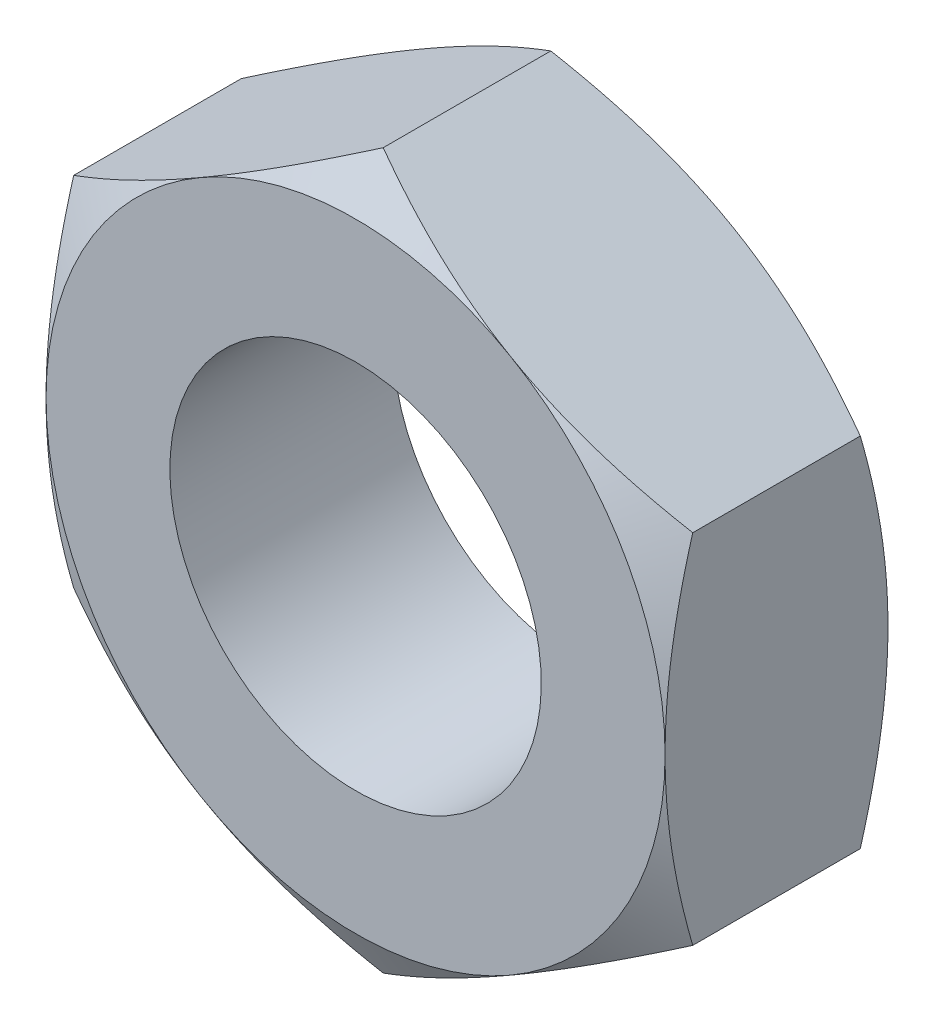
ISO-10303-21;
HEADER;
FILE_DESCRIPTION(('STEP AP214'),'2;1');
FILE_NAME('part.step','',(''),(''),'','','');
FILE_SCHEMA(('AUTOMOTIVE_DESIGN { 1 0 10303 214 1 1 1 1 }'));
ENDSEC;
DATA;
#1=APPLICATION_CONTEXT('core data for automotive mechanical design processes');
#2=APPLICATION_PROTOCOL_DEFINITION('international standard','automotive_design',2000,#1);
#3=PRODUCT_CONTEXT('',#1,'mechanical');
#4=PRODUCT('Part','Part','',(#3));
#5=PRODUCT_RELATED_PRODUCT_CATEGORY('part','',(#4));
#6=PRODUCT_DEFINITION_FORMATION('','',#4);
#7=PRODUCT_DEFINITION_CONTEXT('part definition',#1,'design');
#8=PRODUCT_DEFINITION('design','',#6,#7);
#9=PRODUCT_DEFINITION_SHAPE('','',#8);
#10=(LENGTH_UNIT() NAMED_UNIT(*) SI_UNIT(.MILLI.,.METRE.));
#11=(NAMED_UNIT(*) PLANE_ANGLE_UNIT() SI_UNIT($,.RADIAN.));
#12=(NAMED_UNIT(*) SI_UNIT($,.STERADIAN.) SOLID_ANGLE_UNIT());
#13=UNCERTAINTY_MEASURE_WITH_UNIT(LENGTH_MEASURE(1.E-05),#10,'distance_accuracy_value','');
#14=(GEOMETRIC_REPRESENTATION_CONTEXT(3) GLOBAL_UNCERTAINTY_ASSIGNED_CONTEXT((#13)) GLOBAL_UNIT_ASSIGNED_CONTEXT((#10,
#11,#12)) REPRESENTATION_CONTEXT('',''));
#15=CARTESIAN_POINT('',(0.,0.,0.));
#16=DIRECTION('',(0.,0.,1.));
#17=DIRECTION('',(1.,0.,0.));
#18=AXIS2_PLACEMENT_3D('',#15,#16,#17);
#19=CARTESIAN_POINT('',(0.,0.,3.6));
#20=DIRECTION('',(0.,0.,-1.));
#21=DIRECTION('',(0.,1.,0.));
#22=AXIS2_PLACEMENT_3D('',#19,#20,#21);
#23=PLANE('',#22);
#24=CARTESIAN_POINT('',(0.,0.,3.6));
#25=DIRECTION('',(0.,0.,-1.));
#26=DIRECTION('',(0.,1.,0.));
#27=AXIS2_PLACEMENT_3D('',#24,#25,#26);
#28=CIRCLE('',#27,3.);
#29=CARTESIAN_POINT('',(0.,3.,3.6));
#30=VERTEX_POINT('',#29);
#31=EDGE_CURVE('E263',#30,#30,#28,.T.);
#32=ORIENTED_EDGE('',*,*,#31,.T.);
#33=EDGE_LOOP('',(#32));
#34=FACE_BOUND('',#33,.T.);
#35=CARTESIAN_POINT('',(0.,0.,3.6));
#36=DIRECTION('',(0.,0.,-1.));
#37=DIRECTION('',(0.,1.,0.));
#38=AXIS2_PLACEMENT_3D('',#35,#36,#37);
#39=CIRCLE('',#38,5.);
#40=CARTESIAN_POINT('',(2.5,4.3301270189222,3.6));
#41=VERTEX_POINT('',#40);
#42=CARTESIAN_POINT('',(-2.5,4.33012701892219,3.6));
#43=VERTEX_POINT('',#42);
#44=EDGE_CURVE('E20',#41,#43,#39,.F.);
#45=ORIENTED_EDGE('',*,*,#44,.T.);
#46=CARTESIAN_POINT('',(-5.,0.,3.6));
#47=VERTEX_POINT('',#46);
#48=EDGE_CURVE('E10',#43,#47,#39,.F.);
#49=ORIENTED_EDGE('',*,*,#48,.T.);
#50=CARTESIAN_POINT('',(-2.5,-4.3301270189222,3.6));
#51=VERTEX_POINT('',#50);
#52=EDGE_CURVE('E25',#47,#51,#39,.F.);
#53=ORIENTED_EDGE('',*,*,#52,.T.);
#54=CARTESIAN_POINT('',(2.5,-4.33012701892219,3.6));
#55=VERTEX_POINT('',#54);
#56=EDGE_CURVE('E351',#51,#55,#39,.F.);
#57=ORIENTED_EDGE('',*,*,#56,.T.);
#58=CARTESIAN_POINT('',(5.,0.,3.6));
#59=VERTEX_POINT('',#58);
#60=EDGE_CURVE('E123',#55,#59,#39,.F.);
#61=ORIENTED_EDGE('',*,*,#60,.T.);
#62=CARTESIAN_POINT('',(0.,0.,3.6));
#63=DIRECTION('',(0.,0.,-1.));
#64=DIRECTION('',(0.,1.,0.));
#65=AXIS2_PLACEMENT_3D('',#62,#63,#64);
#66=CIRCLE('',#65,5.);
#67=EDGE_CURVE('E108',#41,#59,#66,.T.);
#68=ORIENTED_EDGE('',*,*,#67,.F.);
#69=EDGE_LOOP('',(#45,#49,#53,#57,#61,#68));
#70=FACE_BOUND('',#69,.T.);
#71=ADVANCED_FACE('F15',(#34,#70),#23,.F.);
#72=CARTESIAN_POINT('',(5.,-2.88675134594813,3.6));
#73=DIRECTION('',(0.5,-0.866025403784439,0.));
#74=DIRECTION('',(-0.866025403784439,-0.5,0.));
#75=AXIS2_PLACEMENT_3D('',#72,#73,#74);
#76=PLANE('',#75);
#77=CARTESIAN_POINT('',(-0.000200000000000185,-5.7736181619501,3.15335134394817));
#78=CARTESIAN_POINT('',(0.219534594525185,-5.64675433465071,3.22661343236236));
#79=CARTESIAN_POINT('',(0.441148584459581,-5.5188054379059,3.29324867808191));
#80=CARTESIAN_POINT('',(0.888213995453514,-5.26069210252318,3.40956100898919));
#81=CARTESIAN_POINT('',(1.11367335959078,-5.13052307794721,3.45919695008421));
#82=CARTESIAN_POINT('',(1.56183230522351,-4.87177839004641,3.5364489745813));
#83=CARTESIAN_POINT('',(1.7844620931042,-4.74324302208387,3.56457962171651));
#84=CARTESIAN_POINT('',(2.11918990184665,-4.54998783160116,3.58980507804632));
#85=CARTESIAN_POINT('',(2.23084219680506,-4.48552534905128,3.59538654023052));
#86=CARTESIAN_POINT('',(2.4542499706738,-4.35654081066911,3.60079778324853));
#87=CARTESIAN_POINT('',(2.56600544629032,-4.2920187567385,3.6006277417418));
#88=CARTESIAN_POINT('',(2.87218423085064,-4.11524635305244,3.59224636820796));
#89=CARTESIAN_POINT('',(3.06650608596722,-4.00305457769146,3.57817022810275));
#90=CARTESIAN_POINT('',(3.45386010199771,-3.77941563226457,3.53353474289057));
#91=CARTESIAN_POINT('',(3.64689090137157,-3.66796924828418,3.50296013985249));
#92=CARTESIAN_POINT('',(4.03502534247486,-3.44387972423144,3.42653150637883));
#93=CARTESIAN_POINT('',(4.23007999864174,-3.3312648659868,3.38035362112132));
#94=CARTESIAN_POINT('',(4.61728034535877,-3.1077146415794,3.27554820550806));
#95=CARTESIAN_POINT('',(4.80943099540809,-2.99677641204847,3.21694529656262));
#96=CARTESIAN_POINT('',(5.0002,-2.88663587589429,3.15335134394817));
#97=B_SPLINE_CURVE_WITH_KNOTS('',3,(#77,#78,#79,#80,#81,#82,#83,#84,#85,#86,#87,#88,#89,#90,#91,
#92,#93,#94,#95,#96),.UNSPECIFIED.,.F.,.F.,(4,2,2,2,2,2,2,2,2,4),(0.,0.792555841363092,
1.58701660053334,2.36181537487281,2.74884076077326,3.13585419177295,3.8096236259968,
4.4840172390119,5.17336882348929,5.86136694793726),.UNSPECIFIED.);
#98=CARTESIAN_POINT('',(0.,-5.77350269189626,3.15341801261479));
#99=VERTEX_POINT('',#98);
#100=EDGE_CURVE('E310',#99,#55,#97,.T.);
#101=ORIENTED_EDGE('',*,*,#100,.F.);
#102=DIRECTION('',(0.,0.,-1.));
#103=VECTOR('',#102,1.);
#104=CARTESIAN_POINT('',(0.,-5.77350269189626,3.6));
#105=LINE('',#104,#103);
#106=CARTESIAN_POINT('',(0.,-5.77350269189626,0.4465819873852));
#107=VERTEX_POINT('',#106);
#108=EDGE_CURVE('E269',#99,#107,#105,.T.);
#109=ORIENTED_EDGE('',*,*,#108,.T.);
#110=CARTESIAN_POINT('',(-0.000200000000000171,-5.7736181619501,0.446648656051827));
#111=CARTESIAN_POINT('',(0.219534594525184,-5.64675433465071,0.373386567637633));
#112=CARTESIAN_POINT('',(0.44114858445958,-5.5188054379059,0.306751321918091));
#113=CARTESIAN_POINT('',(0.888213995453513,-5.26069210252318,0.190438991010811));
#114=CARTESIAN_POINT('',(1.11367335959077,-5.13052307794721,0.140803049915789));
#115=CARTESIAN_POINT('',(1.56183230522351,-4.87177839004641,0.0635510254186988));
#116=CARTESIAN_POINT('',(1.78446209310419,-4.74324302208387,0.0354203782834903));
#117=CARTESIAN_POINT('',(2.11918990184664,-4.54998783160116,0.0101949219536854));
#118=CARTESIAN_POINT('',(2.23084219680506,-4.48552534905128,0.00461345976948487));
#119=CARTESIAN_POINT('',(2.4542499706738,-4.35654081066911,-0.000797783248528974));
#120=CARTESIAN_POINT('',(2.56600544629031,-4.2920187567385,-0.00062774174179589));
#121=CARTESIAN_POINT('',(2.87218423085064,-4.11524635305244,0.00775363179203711));
#122=CARTESIAN_POINT('',(3.06650608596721,-4.00305457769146,0.0218297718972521));
#123=CARTESIAN_POINT('',(3.4538601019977,-3.77941563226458,0.0664652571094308));
#124=CARTESIAN_POINT('',(3.64689090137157,-3.66796924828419,0.0970398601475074));
#125=CARTESIAN_POINT('',(4.03502534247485,-3.44387972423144,0.173468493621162));
#126=CARTESIAN_POINT('',(4.23007999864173,-3.3312648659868,0.219646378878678));
#127=CARTESIAN_POINT('',(4.61728034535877,-3.10771464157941,0.324451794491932));
#128=CARTESIAN_POINT('',(4.80943099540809,-2.99677641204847,0.383054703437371));
#129=CARTESIAN_POINT('',(5.0002,-2.88663587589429,0.446648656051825));
#130=B_SPLINE_CURVE_WITH_KNOTS('',3,(#110,#111,#112,#113,#114,#115,#116,#117,#118,#119,#120,
#121,#122,#123,#124,#125,#126,#127,#128,#129),.UNSPECIFIED.,.F.,.F.,(4,2,2,2,2,2,2,2,2,4),(0.,
0.79255584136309,1.58701660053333,2.3618153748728,2.74884076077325,3.13585419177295,
3.80962362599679,4.48401723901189,5.17336882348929,5.86136694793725),.UNSPECIFIED.);
#131=CARTESIAN_POINT('',(2.5,-4.33012701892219,0.));
#132=VERTEX_POINT('',#131);
#133=EDGE_CURVE('E267',#107,#132,#130,.T.);
#134=ORIENTED_EDGE('',*,*,#133,.T.);
#135=CARTESIAN_POINT('',(5.,-2.88675134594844,0.446581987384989));
#136=VERTEX_POINT('',#135);
#137=EDGE_CURVE('E231',#132,#136,#130,.T.);
#138=ORIENTED_EDGE('',*,*,#137,.T.);
#139=DIRECTION('',(0.,0.,-1.));
#140=VECTOR('',#139,1.);
#141=CARTESIAN_POINT('',(5.,-2.88675134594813,3.6));
#142=LINE('',#141,#140);
#143=CARTESIAN_POINT('',(5.,-2.88675134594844,3.153418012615));
#144=VERTEX_POINT('',#143);
#145=EDGE_CURVE('E272',#144,#136,#142,.T.);
#146=ORIENTED_EDGE('',*,*,#145,.F.);
#147=EDGE_CURVE('E313',#55,#144,#97,.T.);
#148=ORIENTED_EDGE('',*,*,#147,.F.);
#149=EDGE_LOOP('',(#101,#109,#134,#138,#146,#148));
#150=FACE_BOUND('',#149,.T.);
#151=ADVANCED_FACE('F17',(#150),#76,.T.);
#152=CARTESIAN_POINT('',(5.,2.88675134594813,3.6));
#153=DIRECTION('',(1.,0.,0.));
#154=DIRECTION('',(0.,-1.,0.));
#155=AXIS2_PLACEMENT_3D('',#152,#153,#154);
#156=PLANE('',#155);
#157=CARTESIAN_POINT('',(5.,-7.84540937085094,1.11551783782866));
#158=CARTESIAN_POINT('',(5.,-7.62621611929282,1.22220989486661));
#159=CARTESIAN_POINT('',(5.,-7.40652933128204,1.32790490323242));
#160=CARTESIAN_POINT('',(5.,-6.96590650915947,1.53674173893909));
#161=CARTESIAN_POINT('',(5.,-6.74497029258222,1.6398831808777));
#162=CARTESIAN_POINT('',(5.,-6.30049162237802,1.84355318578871));
#163=CARTESIAN_POINT('',(5.,-6.07694157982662,1.94406524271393));
#164=CARTESIAN_POINT('',(5.,-5.62809477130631,2.14109534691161));
#165=CARTESIAN_POINT('',(5.,-5.40279808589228,2.23761357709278));
#166=CARTESIAN_POINT('',(5.,-4.94254415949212,2.42874204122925));
#167=CARTESIAN_POINT('',(5.,-4.70751545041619,2.52318108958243));
#168=CARTESIAN_POINT('',(5.,-4.23474237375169,2.70513008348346));
#169=CARTESIAN_POINT('',(5.,-3.99699770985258,2.79263926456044));
#170=CARTESIAN_POINT('',(5.,-3.51883048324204,2.95849831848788));
#171=CARTESIAN_POINT('',(5.,-3.27841414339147,3.03686595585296));
#172=CARTESIAN_POINT('',(5.,-2.79413397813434,3.18198794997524));
#173=CARTESIAN_POINT('',(5.,-2.55027123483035,3.2487458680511));
#174=CARTESIAN_POINT('',(5.,-2.06030150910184,3.36715301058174));
#175=CARTESIAN_POINT('',(5.,-1.81421506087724,3.41888566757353));
#176=CARTESIAN_POINT('',(5.,-1.31888880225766,3.50437350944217));
#177=CARTESIAN_POINT('',(5.,-1.0696493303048,3.53813060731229));
#178=CARTESIAN_POINT('',(5.,-0.572554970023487,3.58453676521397));
#179=CARTESIAN_POINT('',(5.,-0.32472674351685,3.59746436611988));
#180=CARTESIAN_POINT('',(5.,0.171145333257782,3.60185476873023));
#181=CARTESIAN_POINT('',(5.,0.419189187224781,3.59331719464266));
#182=CARTESIAN_POINT('',(5.,0.837577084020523,3.56142527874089));
#183=CARTESIAN_POINT('',(5.,1.00835703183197,3.5434350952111));
#184=CARTESIAN_POINT('',(5.,1.34871889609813,3.49835039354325));
#185=CARTESIAN_POINT('',(5.,1.51830065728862,3.47125471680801));
#186=CARTESIAN_POINT('',(5.,2.02498894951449,3.37772826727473));
#187=CARTESIAN_POINT('',(5.,2.3598670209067,3.29907292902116));
#188=CARTESIAN_POINT('',(5.,2.86083504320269,3.1619932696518));
#189=CARTESIAN_POINT('',(5.,3.02950143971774,3.11244287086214));
#190=CARTESIAN_POINT('',(5.,3.36519695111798,3.00802721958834));
#191=CARTESIAN_POINT('',(5.,3.53222605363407,2.95316192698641));
#192=CARTESIAN_POINT('',(5.,3.86469849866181,2.8390109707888));
#193=CARTESIAN_POINT('',(5.,4.03014228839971,2.77972659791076));
#194=CARTESIAN_POINT('',(5.,4.35964613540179,2.6574518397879));
#195=CARTESIAN_POINT('',(5.,4.5237062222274,2.59446153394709));
#196=CARTESIAN_POINT('',(5.,4.95905891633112,2.42256600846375));
#197=CARTESIAN_POINT('',(5.,5.22927143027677,2.31092808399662));
#198=CARTESIAN_POINT('',(5.,5.76697185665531,2.08125057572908));
#199=CARTESIAN_POINT('',(5.,6.03445948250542,1.96321032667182));
#200=CARTESIAN_POINT('',(5.,6.56732294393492,1.7222190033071));
#201=CARTESIAN_POINT('',(5.,6.8326979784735,1.5992661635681));
#202=CARTESIAN_POINT('',(5.,7.36165732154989,1.34960482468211));
#203=CARTESIAN_POINT('',(5.,7.62524169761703,1.22289646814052));
#204=CARTESIAN_POINT('',(5.,8.15137416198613,0.966333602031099));
#205=CARTESIAN_POINT('',(5.,8.41392003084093,0.836474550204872));
#206=CARTESIAN_POINT('',(5.,8.93783268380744,0.574396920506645));
#207=CARTESIAN_POINT('',(5.,9.19919945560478,0.442178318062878));
#208=CARTESIAN_POINT('',(5.,9.98174453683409,0.0427510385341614));
#209=CARTESIAN_POINT('',(5.,10.5014794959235,-0.227284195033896));
#210=CARTESIAN_POINT('',(5.,11.4847324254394,-0.744259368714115));
#211=CARTESIAN_POINT('',(5.,11.9485121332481,-0.990703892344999));
#212=CARTESIAN_POINT('',(5.,12.8744976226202,-1.48659504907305));
#213=CARTESIAN_POINT('',(5.,13.3367033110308,-1.73604185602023));
#214=CARTESIAN_POINT('',(5.,14.2584061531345,-2.23635039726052));
#215=CARTESIAN_POINT('',(5.,14.717907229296,-2.4872049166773));
#216=CARTESIAN_POINT('',(5.,15.6359256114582,-2.99062629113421));
#217=CARTESIAN_POINT('',(5.,16.0944429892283,-3.24319301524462));
#218=CARTESIAN_POINT('',(5.,16.5526129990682,-3.49638438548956));
#219=B_SPLINE_CURVE_WITH_KNOTS('',3,(#157,#158,#159,#160,#161,#162,#163,#164,#165,#166,#167,
#168,#169,#170,#171,#172,#173,#174,#175,#176,#177,#178,#179,#180,#181,#182,#183,#184,#185,#186,
#187,#188,#189,#190,#191,#192,#193,#194,#195,#196,#197,#198,#199,#200,#201,#202,#203,#204,#205,
#206,#207,#208,#209,#210,#211,#212,#213,#214,#215,#216,#217,#218),.UNSPECIFIED.,.F.,.F.,(4,2,2,
2,2,2,2,2,2,2,2,2,2,2,2,2,2,2,2,2,2,2,2,2,2,2,2,2,2,2,4),(0.,0.731349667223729,1.46280905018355,
2.19809782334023,2.93335288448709,3.69314668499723,4.45302418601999,5.21139953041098,
5.96954182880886,6.72339008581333,7.47715810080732,8.22076015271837,8.96437522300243,
9.47930193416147,9.9942941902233,11.0247926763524,11.5521280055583,12.0794673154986,
12.6066532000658,13.1338277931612,14.0108033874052,14.8878702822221,15.7652552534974,
16.6426069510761,17.521309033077,18.4000202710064,20.1570686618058,21.7326330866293,
23.3082891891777,24.8788339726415,26.4492599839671),.UNSPECIFIED.);
#220=EDGE_CURVE('E318',#144,#59,#219,.T.);
#221=ORIENTED_EDGE('',*,*,#220,.F.);
#222=ORIENTED_EDGE('',*,*,#145,.T.);
#223=CARTESIAN_POINT('',(5.,-7.84540937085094,2.48448216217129));
#224=CARTESIAN_POINT('',(5.,-7.62621611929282,2.37779010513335));
#225=CARTESIAN_POINT('',(5.,-7.40652933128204,2.27209509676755));
#226=CARTESIAN_POINT('',(5.,-6.96590650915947,2.06325826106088));
#227=CARTESIAN_POINT('',(5.,-6.74497029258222,1.96011681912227));
#228=CARTESIAN_POINT('',(5.,-6.30049162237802,1.75644681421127));
#229=CARTESIAN_POINT('',(5.,-6.07694157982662,1.65593475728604));
#230=CARTESIAN_POINT('',(5.,-5.62809477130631,1.45890465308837));
#231=CARTESIAN_POINT('',(5.,-5.40279808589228,1.36238642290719));
#232=CARTESIAN_POINT('',(5.,-4.94254415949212,1.17125795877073));
#233=CARTESIAN_POINT('',(5.,-4.70751545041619,1.07681891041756));
#234=CARTESIAN_POINT('',(5.,-4.23474237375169,0.894869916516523));
#235=CARTESIAN_POINT('',(5.,-3.99699770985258,0.807360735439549));
#236=CARTESIAN_POINT('',(5.,-3.51883048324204,0.641501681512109));
#237=CARTESIAN_POINT('',(5.,-3.27841414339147,0.563134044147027));
#238=CARTESIAN_POINT('',(5.,-2.79413397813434,0.418012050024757));
#239=CARTESIAN_POINT('',(5.,-2.55027123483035,0.351254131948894));
#240=CARTESIAN_POINT('',(5.,-2.06030150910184,0.232846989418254));
#241=CARTESIAN_POINT('',(5.,-1.81421506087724,0.181114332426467));
#242=CARTESIAN_POINT('',(5.,-1.31888880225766,0.0956264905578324));
#243=CARTESIAN_POINT('',(5.,-1.0696493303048,0.0618693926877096));
#244=CARTESIAN_POINT('',(5.,-0.572554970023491,0.0154632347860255));
#245=CARTESIAN_POINT('',(5.,-0.324726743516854,0.00253563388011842));
#246=CARTESIAN_POINT('',(5.,0.171145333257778,-0.0018547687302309));
#247=CARTESIAN_POINT('',(5.,0.419189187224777,0.0066828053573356));
#248=CARTESIAN_POINT('',(5.,0.837577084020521,0.038574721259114));
#249=CARTESIAN_POINT('',(5.,1.00835703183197,0.0565649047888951));
#250=CARTESIAN_POINT('',(5.,1.34871889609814,0.101649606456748));
#251=CARTESIAN_POINT('',(5.,1.51830065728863,0.128745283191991));
#252=CARTESIAN_POINT('',(5.,2.02498894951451,0.222271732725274));
#253=CARTESIAN_POINT('',(5.,2.35986702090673,0.300927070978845));
#254=CARTESIAN_POINT('',(5.,2.86083504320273,0.438006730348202));
#255=CARTESIAN_POINT('',(5.,3.02950143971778,0.487557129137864));
#256=CARTESIAN_POINT('',(5.,3.36519695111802,0.591972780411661));
#257=CARTESIAN_POINT('',(5.,3.53222605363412,0.646838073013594));
#258=CARTESIAN_POINT('',(5.,3.86469849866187,0.760989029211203));
#259=CARTESIAN_POINT('',(5.,4.03014228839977,0.820273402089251));
#260=CARTESIAN_POINT('',(5.,4.35964613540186,0.942548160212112));
#261=CARTESIAN_POINT('',(5.,4.52370622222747,1.00553846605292));
#262=CARTESIAN_POINT('',(5.,4.95905891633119,1.17743399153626));
#263=CARTESIAN_POINT('',(5.,5.22927143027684,1.28907191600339));
#264=CARTESIAN_POINT('',(5.,5.76697185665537,1.51874942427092));
#265=CARTESIAN_POINT('',(5.,6.03445948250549,1.63678967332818));
#266=CARTESIAN_POINT('',(5.,6.56732294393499,1.8777809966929));
#267=CARTESIAN_POINT('',(5.,6.83269797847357,2.0007338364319));
#268=CARTESIAN_POINT('',(5.,7.36165732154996,2.25039517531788));
#269=CARTESIAN_POINT('',(5.,7.62524169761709,2.37710353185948));
#270=CARTESIAN_POINT('',(5.,8.15137416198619,2.63366639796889));
#271=CARTESIAN_POINT('',(5.,8.41392003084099,2.76352544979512));
#272=CARTESIAN_POINT('',(5.,8.9378326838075,3.02560307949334));
#273=CARTESIAN_POINT('',(5.,9.19919945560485,3.15782168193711));
#274=CARTESIAN_POINT('',(5.,9.98174453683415,3.55724896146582));
#275=CARTESIAN_POINT('',(5.,10.5014794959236,3.82728419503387));
#276=CARTESIAN_POINT('',(5.,11.4847324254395,4.34425936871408));
#277=CARTESIAN_POINT('',(5.,11.9485121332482,4.59070389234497));
#278=CARTESIAN_POINT('',(5.,12.8744976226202,5.08659504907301));
#279=CARTESIAN_POINT('',(5.,13.3367033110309,5.33604185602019));
#280=CARTESIAN_POINT('',(5.,14.2584061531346,5.83635039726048));
#281=CARTESIAN_POINT('',(5.,14.7179072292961,6.08720491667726));
#282=CARTESIAN_POINT('',(5.,15.6359256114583,6.59062629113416));
#283=CARTESIAN_POINT('',(5.,16.0944429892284,6.84319301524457));
#284=CARTESIAN_POINT('',(5.,16.5526129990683,7.0963843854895));
#285=B_SPLINE_CURVE_WITH_KNOTS('',3,(#223,#224,#225,#226,#227,#228,#229,#230,#231,#232,#233,
#234,#235,#236,#237,#238,#239,#240,#241,#242,#243,#244,#245,#246,#247,#248,#249,#250,#251,#252,
#253,#254,#255,#256,#257,#258,#259,#260,#261,#262,#263,#264,#265,#266,#267,#268,#269,#270,#271,
#272,#273,#274,#275,#276,#277,#278,#279,#280,#281,#282,#283,#284),.UNSPECIFIED.,.F.,.F.,(4,2,2,
2,2,2,2,2,2,2,2,2,2,2,2,2,2,2,2,2,2,2,2,2,2,2,2,2,2,2,4),(0.,0.731349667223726,1.46280905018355,
2.19809782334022,2.93335288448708,3.69314668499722,4.45302418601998,5.21139953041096,
5.96954182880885,6.72339008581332,7.4771581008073,8.22076015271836,8.96437522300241,
9.47930193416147,9.9942941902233,11.0247926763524,11.5521280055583,12.0794673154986,
12.6066532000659,13.1338277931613,14.0108033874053,14.8878702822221,15.7652552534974,
16.6426069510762,17.521309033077,18.4000202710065,20.1570686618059,21.7326330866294,
23.3082891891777,24.8788339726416,26.4492599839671),.UNSPECIFIED.);
#286=CARTESIAN_POINT('',(5.,0.,0.));
#287=VERTEX_POINT('',#286);
#288=EDGE_CURVE('E230',#136,#287,#285,.T.);
#289=ORIENTED_EDGE('',*,*,#288,.T.);
#290=CARTESIAN_POINT('',(5.,2.88675134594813,0.446581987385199));
#291=VERTEX_POINT('',#290);
#292=EDGE_CURVE('E223',#287,#291,#285,.T.);
#293=ORIENTED_EDGE('',*,*,#292,.T.);
#294=DIRECTION('',(0.,0.,-1.));
#295=VECTOR('',#294,1.);
#296=CARTESIAN_POINT('',(5.,2.88675134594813,3.6));
#297=LINE('',#296,#295);
#298=CARTESIAN_POINT('',(5.,2.88675134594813,3.15341801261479));
#299=VERTEX_POINT('',#298);
#300=EDGE_CURVE('E275',#299,#291,#297,.T.);
#301=ORIENTED_EDGE('',*,*,#300,.F.);
#302=EDGE_CURVE('E111',#59,#299,#219,.T.);
#303=ORIENTED_EDGE('',*,*,#302,.F.);
#304=EDGE_LOOP('',(#221,#222,#289,#293,#301,#303));
#305=FACE_BOUND('',#304,.T.);
#306=ADVANCED_FACE('F237',(#305),#156,.T.);
#307=CARTESIAN_POINT('',(0.,5.77350269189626,3.6));
#308=DIRECTION('',(0.5,0.866025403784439,0.));
#309=DIRECTION('',(0.866025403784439,-0.5,0.));
#310=AXIS2_PLACEMENT_3D('',#307,#308,#309);
#311=PLANE('',#310);
#312=CARTESIAN_POINT('',(5.0002,2.88663587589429,3.15335134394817));
#313=CARTESIAN_POINT('',(4.78046540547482,3.01349970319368,3.22661343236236));
#314=CARTESIAN_POINT('',(4.55885141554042,3.14144859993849,3.29324867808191));
#315=CARTESIAN_POINT('',(4.11178600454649,3.39956193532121,3.40956100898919));
#316=CARTESIAN_POINT('',(3.88632664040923,3.52973095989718,3.45919695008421));
#317=CARTESIAN_POINT('',(3.43816769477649,3.78847564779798,3.5364489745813));
#318=CARTESIAN_POINT('',(3.21553790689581,3.91701101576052,3.56457962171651));
#319=CARTESIAN_POINT('',(2.88081009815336,4.11026620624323,3.58980507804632));
#320=CARTESIAN_POINT('',(2.76915780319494,4.17472868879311,3.59538654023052));
#321=CARTESIAN_POINT('',(2.5457500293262,4.30371322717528,3.60079778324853));
#322=CARTESIAN_POINT('',(2.43399455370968,4.36823528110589,3.6006277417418));
#323=CARTESIAN_POINT('',(2.12781576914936,4.54500768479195,3.59224636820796));
#324=CARTESIAN_POINT('',(1.93349391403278,4.65719946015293,3.57817022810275));
#325=CARTESIAN_POINT('',(1.54613989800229,4.88083840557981,3.53353474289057));
#326=CARTESIAN_POINT('',(1.35310909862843,4.9922847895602,3.50296013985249));
#327=CARTESIAN_POINT('',(0.964974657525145,5.21637431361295,3.42653150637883));
#328=CARTESIAN_POINT('',(0.769920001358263,5.32898917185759,3.38035362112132));
#329=CARTESIAN_POINT('',(0.382719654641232,5.55253939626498,3.27554820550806));
#330=CARTESIAN_POINT('',(0.190569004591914,5.66347762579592,3.21694529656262));
#331=CARTESIAN_POINT('',(-0.000199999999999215,5.7736181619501,3.15335134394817));
#332=B_SPLINE_CURVE_WITH_KNOTS('',3,(#312,#313,#314,#315,#316,#317,#318,#319,#320,#321,#322,
#323,#324,#325,#326,#327,#328,#329,#330,#331),.UNSPECIFIED.,.F.,.F.,(4,2,2,2,2,2,2,2,2,4),(0.,
0.792555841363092,1.58701660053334,2.36181537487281,2.74884076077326,3.13585419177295,
3.8096236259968,4.48401723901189,5.17336882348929,5.86136694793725),.UNSPECIFIED.);
#333=EDGE_CURVE('E104',#299,#41,#332,.T.);
#334=ORIENTED_EDGE('',*,*,#333,.F.);
#335=ORIENTED_EDGE('',*,*,#300,.T.);
#336=CARTESIAN_POINT('',(5.0002,2.88663587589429,0.446648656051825));
#337=CARTESIAN_POINT('',(4.78046540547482,3.01349970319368,0.373386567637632));
#338=CARTESIAN_POINT('',(4.55885141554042,3.14144859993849,0.30675132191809));
#339=CARTESIAN_POINT('',(4.11178600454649,3.39956193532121,0.19043899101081));
#340=CARTESIAN_POINT('',(3.88632664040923,3.52973095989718,0.140803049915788));
#341=CARTESIAN_POINT('',(3.43816769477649,3.78847564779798,0.0635510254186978));
#342=CARTESIAN_POINT('',(3.21553790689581,3.91701101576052,0.0354203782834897));
#343=CARTESIAN_POINT('',(2.88081009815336,4.11026620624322,0.010194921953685));
#344=CARTESIAN_POINT('',(2.76915780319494,4.17472868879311,0.00461345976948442));
#345=CARTESIAN_POINT('',(2.5457500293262,4.30371322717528,-0.00079778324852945));
#346=CARTESIAN_POINT('',(2.43399455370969,4.36823528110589,-0.000627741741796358));
#347=CARTESIAN_POINT('',(2.12781576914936,4.54500768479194,0.00775363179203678));
#348=CARTESIAN_POINT('',(1.93349391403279,4.65719946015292,0.021829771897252));
#349=CARTESIAN_POINT('',(1.5461398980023,4.88083840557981,0.0664652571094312));
#350=CARTESIAN_POINT('',(1.35310909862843,4.9922847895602,0.0970398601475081));
#351=CARTESIAN_POINT('',(0.964974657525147,5.21637431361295,0.173468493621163));
#352=CARTESIAN_POINT('',(0.769920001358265,5.32898917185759,0.219646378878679));
#353=CARTESIAN_POINT('',(0.382719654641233,5.55253939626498,0.324451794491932));
#354=CARTESIAN_POINT('',(0.190569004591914,5.66347762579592,0.383054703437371));
#355=CARTESIAN_POINT('',(-0.000199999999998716,5.7736181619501,0.446648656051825));
#356=B_SPLINE_CURVE_WITH_KNOTS('',3,(#336,#337,#338,#339,#340,#341,#342,#343,#344,#345,#346,
#347,#348,#349,#350,#351,#352,#353,#354,#355),.UNSPECIFIED.,.F.,.F.,(4,2,2,2,2,2,2,2,2,4),(0.,
0.792555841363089,1.58701660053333,2.3618153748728,2.74884076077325,3.13585419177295,
3.80962362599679,4.48401723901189,5.17336882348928,5.86136694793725),.UNSPECIFIED.);
#357=CARTESIAN_POINT('',(2.5,4.3301270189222,0.));
#358=VERTEX_POINT('',#357);
#359=EDGE_CURVE('E222',#291,#358,#356,.T.);
#360=ORIENTED_EDGE('',*,*,#359,.T.);
#361=CARTESIAN_POINT('',(0.,5.77350269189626,0.446581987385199));
#362=VERTEX_POINT('',#361);
#363=EDGE_CURVE('E216',#358,#362,#356,.T.);
#364=ORIENTED_EDGE('',*,*,#363,.T.);
#365=DIRECTION('',(0.,0.,-1.));
#366=VECTOR('',#365,1.);
#367=CARTESIAN_POINT('',(0.,5.77350269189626,3.6));
#368=LINE('',#367,#366);
#369=CARTESIAN_POINT('',(0.,5.77350269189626,3.1534180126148));
#370=VERTEX_POINT('',#369);
#371=EDGE_CURVE('E131',#370,#362,#368,.T.);
#372=ORIENTED_EDGE('',*,*,#371,.F.);
#373=EDGE_CURVE('E115',#41,#370,#332,.T.);
#374=ORIENTED_EDGE('',*,*,#373,.F.);
#375=EDGE_LOOP('',(#334,#335,#360,#364,#372,#374));
#376=FACE_BOUND('',#375,.T.);
#377=ADVANCED_FACE('F129',(#376),#311,.T.);
#378=CARTESIAN_POINT('',(-5.,2.88675134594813,3.6));
#379=DIRECTION('',(-0.5,0.866025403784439,0.));
#380=DIRECTION('',(0.866025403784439,0.5,0.));
#381=AXIS2_PLACEMENT_3D('',#378,#379,#380);
#382=PLANE('',#381);
#383=CARTESIAN_POINT('',(0.000200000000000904,5.77361816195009,3.15335134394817));
#384=CARTESIAN_POINT('',(-0.219534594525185,5.64675433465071,3.22661343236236));
#385=CARTESIAN_POINT('',(-0.44114858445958,5.5188054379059,3.29324867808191));
#386=CARTESIAN_POINT('',(-0.888213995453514,5.26069210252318,3.40956100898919));
#387=CARTESIAN_POINT('',(-1.11367335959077,5.13052307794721,3.45919695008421));
#388=CARTESIAN_POINT('',(-1.56183230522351,4.87177839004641,3.5364489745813));
#389=CARTESIAN_POINT('',(-1.78446209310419,4.74324302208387,3.56457962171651));
#390=CARTESIAN_POINT('',(-2.11918990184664,4.54998783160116,3.58980507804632));
#391=CARTESIAN_POINT('',(-2.23084219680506,4.48552534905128,3.59538654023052));
#392=CARTESIAN_POINT('',(-2.4542499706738,4.35654081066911,3.60079778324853));
#393=CARTESIAN_POINT('',(-2.56600544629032,4.2920187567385,3.6006277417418));
#394=CARTESIAN_POINT('',(-2.87218423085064,4.11524635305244,3.59224636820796));
#395=CARTESIAN_POINT('',(-3.06650608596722,4.00305457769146,3.57817022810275));
#396=CARTESIAN_POINT('',(-3.45386010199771,3.77941563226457,3.53353474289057));
#397=CARTESIAN_POINT('',(-3.64689090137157,3.66796924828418,3.50296013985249));
#398=CARTESIAN_POINT('',(-4.03502534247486,3.44387972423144,3.42653150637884));
#399=CARTESIAN_POINT('',(-4.23007999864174,3.3312648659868,3.38035362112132));
#400=CARTESIAN_POINT('',(-4.61728034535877,3.1077146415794,3.27554820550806));
#401=CARTESIAN_POINT('',(-4.80943099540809,2.99677641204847,3.21694529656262));
#402=CARTESIAN_POINT('',(-5.0002,2.88663587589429,3.15335134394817));
#403=B_SPLINE_CURVE_WITH_KNOTS('',3,(#383,#384,#385,#386,#387,#388,#389,#390,#391,#392,#393,
#394,#395,#396,#397,#398,#399,#400,#401,#402),.UNSPECIFIED.,.F.,.F.,(4,2,2,2,2,2,2,2,2,4),(0.,
0.792555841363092,1.58701660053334,2.36181537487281,2.74884076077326,3.13585419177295,
3.80962362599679,4.48401723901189,5.17336882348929,5.86136694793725),.UNSPECIFIED.);
#404=EDGE_CURVE('E121',#370,#43,#403,.T.);
#405=ORIENTED_EDGE('',*,*,#404,.F.);
#406=ORIENTED_EDGE('',*,*,#371,.T.);
#407=CARTESIAN_POINT('',(0.000200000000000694,5.77361816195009,0.446648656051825));
#408=CARTESIAN_POINT('',(-0.219534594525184,5.6467543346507,0.373386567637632));
#409=CARTESIAN_POINT('',(-0.44114858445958,5.5188054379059,0.306751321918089));
#410=CARTESIAN_POINT('',(-0.888213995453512,5.26069210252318,0.19043899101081));
#411=CARTESIAN_POINT('',(-1.11367335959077,5.13052307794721,0.140803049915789));
#412=CARTESIAN_POINT('',(-1.56183230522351,4.87177839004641,0.0635510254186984));
#413=CARTESIAN_POINT('',(-1.78446209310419,4.74324302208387,0.0354203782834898));
#414=CARTESIAN_POINT('',(-2.11918990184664,4.54998783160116,0.0101949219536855));
#415=CARTESIAN_POINT('',(-2.23084219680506,4.48552534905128,0.0046134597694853));
#416=CARTESIAN_POINT('',(-2.4542499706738,4.35654081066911,-0.000797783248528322));
#417=CARTESIAN_POINT('',(-2.56600544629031,4.2920187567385,-0.000627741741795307));
#418=CARTESIAN_POINT('',(-2.87218423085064,4.11524635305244,0.00775363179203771));
#419=CARTESIAN_POINT('',(-3.06650608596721,4.00305457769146,0.0218297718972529));
#420=CARTESIAN_POINT('',(-3.4538601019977,3.77941563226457,0.0664652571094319));
#421=CARTESIAN_POINT('',(-3.64689090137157,3.66796924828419,0.0970398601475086));
#422=CARTESIAN_POINT('',(-4.03502534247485,3.44387972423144,0.173468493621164));
#423=CARTESIAN_POINT('',(-4.23007999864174,3.3312648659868,0.21964637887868));
#424=CARTESIAN_POINT('',(-4.61728034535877,3.1077146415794,0.324451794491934));
#425=CARTESIAN_POINT('',(-4.80943099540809,2.99677641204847,0.383054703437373));
#426=CARTESIAN_POINT('',(-5.0002,2.88663587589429,0.446648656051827));
#427=B_SPLINE_CURVE_WITH_KNOTS('',3,(#407,#408,#409,#410,#411,#412,#413,#414,#415,#416,#417,
#418,#419,#420,#421,#422,#423,#424,#425,#426),.UNSPECIFIED.,.F.,.F.,(4,2,2,2,2,2,2,2,2,4),(0.,
0.79255584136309,1.58701660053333,2.3618153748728,2.74884076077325,3.13585419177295,
3.80962362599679,4.48401723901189,5.17336882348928,5.86136694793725),.UNSPECIFIED.);
#428=CARTESIAN_POINT('',(-2.5,4.3301270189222,0.));
#429=VERTEX_POINT('',#428);
#430=EDGE_CURVE('E215',#362,#429,#427,.T.);
#431=ORIENTED_EDGE('',*,*,#430,.T.);
#432=CARTESIAN_POINT('',(-5.,2.88675134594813,0.446581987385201));
#433=VERTEX_POINT('',#432);
#434=EDGE_CURVE('E208',#429,#433,#427,.T.);
#435=ORIENTED_EDGE('',*,*,#434,.T.);
#436=DIRECTION('',(0.,0.,-1.));
#437=VECTOR('',#436,1.);
#438=CARTESIAN_POINT('',(-5.,2.88675134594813,3.6));
#439=LINE('',#438,#437);
#440=CARTESIAN_POINT('',(-5.,2.88675134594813,3.15341801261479));
#441=VERTEX_POINT('',#440);
#442=EDGE_CURVE('E278',#441,#433,#439,.T.);
#443=ORIENTED_EDGE('',*,*,#442,.F.);
#444=EDGE_CURVE('E132',#43,#441,#403,.T.);
#445=ORIENTED_EDGE('',*,*,#444,.F.);
#446=EDGE_LOOP('',(#405,#406,#431,#435,#443,#445));
#447=FACE_BOUND('',#446,.T.);
#448=ADVANCED_FACE('F186',(#447),#382,.T.);
#449=CARTESIAN_POINT('',(-5.,-2.88675134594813,3.6));
#450=DIRECTION('',(-1.,0.,0.));
#451=DIRECTION('',(0.,1.,0.));
#452=AXIS2_PLACEMENT_3D('',#449,#450,#451);
#453=PLANE('',#452);
#454=CARTESIAN_POINT('',(-5.,-7.84540937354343,1.11551783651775));
#455=CARTESIAN_POINT('',(-5.,-7.62621612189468,1.22220989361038));
#456=CARTESIAN_POINT('',(-5.,-7.40652933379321,1.32790490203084));
#457=CARTESIAN_POINT('',(-5.,-6.96590651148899,1.53674173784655));
#458=CARTESIAN_POINT('',(-5.,-6.74497029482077,1.63988317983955));
#459=CARTESIAN_POINT('',(-5.,-6.30049162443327,1.84355318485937));
#460=CARTESIAN_POINT('',(-5.,-6.07694158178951,1.94406524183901));
#461=CARTESIAN_POINT('',(-5.,-5.62809477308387,2.1410953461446));
#462=CARTESIAN_POINT('',(-5.,-5.40279808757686,2.23761357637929));
#463=CARTESIAN_POINT('',(-5.,-4.94254416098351,2.42874204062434));
#464=CARTESIAN_POINT('',(-5.,-4.70751545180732,2.52318108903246));
#465=CARTESIAN_POINT('',(-5.,-4.23474237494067,2.70513008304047));
#466=CARTESIAN_POINT('',(-5.,-3.99699771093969,2.79263926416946));
#467=CARTESIAN_POINT('',(-5.,-3.51883048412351,2.958498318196));
#468=CARTESIAN_POINT('',(-5.,-3.27841414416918,3.03686595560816));
#469=CARTESIAN_POINT('',(-5.,-2.79413397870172,3.18198794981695));
#470=CARTESIAN_POINT('',(-5.,-2.55027123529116,3.24874586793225));
#471=CARTESIAN_POINT('',(-5.,-2.06030150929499,3.3671530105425));
#472=CARTESIAN_POINT('',(-5.,-1.81421506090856,3.41888566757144));
#473=CARTESIAN_POINT('',(-5.,-1.3188888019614,3.50437350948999));
#474=CARTESIAN_POINT('',(-5.,-1.06964932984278,3.53813060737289));
#475=CARTESIAN_POINT('',(-5.,-0.572554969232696,3.58453676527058));
#476=CARTESIAN_POINT('',(-5.,-0.324726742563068,3.59746436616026));
#477=CARTESIAN_POINT('',(-5.,0.171145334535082,3.60185476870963));
#478=CARTESIAN_POINT('',(-5.,0.419189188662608,3.59331719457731));
#479=CARTESIAN_POINT('',(-5.,0.837577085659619,3.56142527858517));
#480=CARTESIAN_POINT('',(-5.,1.00835703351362,3.54343509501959));
#481=CARTESIAN_POINT('',(-5.,1.348718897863,3.49835039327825));
#482=CARTESIAN_POINT('',(-5.,1.51830065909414,3.47125471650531));
#483=CARTESIAN_POINT('',(-5.,2.02498895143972,3.37772826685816));
#484=CARTESIAN_POINT('',(-5.,2.35986702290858,3.29907292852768));
#485=CARTESIAN_POINT('',(-5.,2.86083504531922,3.16199326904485));
#486=CARTESIAN_POINT('',(-5.,3.02950144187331,3.1124428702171));
#487=CARTESIAN_POINT('',(-5.,3.36519695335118,3.0080272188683));
#488=CARTESIAN_POINT('',(-5.,3.53222605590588,2.95316192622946));
#489=CARTESIAN_POINT('',(-5.,3.86469850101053,2.83901096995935));
#490=CARTESIAN_POINT('',(-5.,4.03014229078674,2.77972659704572));
#491=CARTESIAN_POINT('',(-5.,4.35964613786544,2.65745183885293));
#492=CARTESIAN_POINT('',(-5.,4.52370622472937,2.59446153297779));
#493=CARTESIAN_POINT('',(-5.,4.95905891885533,2.42256600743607));
#494=CARTESIAN_POINT('',(-5.,5.229271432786,2.31092808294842));
#495=CARTESIAN_POINT('',(-5.,5.76697185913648,2.08125057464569));
#496=CARTESIAN_POINT('',(-5.,6.03445948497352,1.96321032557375));
#497=CARTESIAN_POINT('',(-5.,6.56732294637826,1.72221900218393));
#498=CARTESIAN_POINT('',(-5.,6.83269798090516,1.59926616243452));
#499=CARTESIAN_POINT('',(-5.,7.36165732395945,1.34960482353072));
#500=CARTESIAN_POINT('',(-5.,7.62524170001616,1.22289646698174));
#501=CARTESIAN_POINT('',(-5.,8.15137416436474,0.966333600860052));
#502=CARTESIAN_POINT('',(-5.,8.41392003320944,0.836474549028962));
#503=CARTESIAN_POINT('',(-5.,8.93783268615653,0.574396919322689));
#504=CARTESIAN_POINT('',(-5.,9.19919945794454,0.442178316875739));
#505=CARTESIAN_POINT('',(-5.,9.98174453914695,0.0427510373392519));
#506=CARTESIAN_POINT('',(-5.,10.5014794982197,-0.227284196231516));
#507=CARTESIAN_POINT('',(-5.,11.4847324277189,-0.744259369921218));
#508=CARTESIAN_POINT('',(-5.,11.9485121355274,-0.990703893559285));
#509=CARTESIAN_POINT('',(-5.,12.8744976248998,-1.48659505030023));
#510=CARTESIAN_POINT('',(-5.,13.336703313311,-1.73604185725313));
#511=CARTESIAN_POINT('',(-5.,14.2584061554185,-2.23635039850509));
#512=CARTESIAN_POINT('',(-5.,14.7179072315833,-2.48720491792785));
#513=CARTESIAN_POINT('',(-5.,15.6359256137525,-2.99062629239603));
#514=CARTESIAN_POINT('',(-5.,16.0944429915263,-3.24319301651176));
#515=CARTESIAN_POINT('',(-5.,16.5526130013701,-3.49638438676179));
#516=B_SPLINE_CURVE_WITH_KNOTS('',3,(#454,#455,#456,#457,#458,#459,#460,#461,#462,#463,#464,
#465,#466,#467,#468,#469,#470,#471,#472,#473,#474,#475,#476,#477,#478,#479,#480,#481,#482,#483,
#484,#485,#486,#487,#488,#489,#490,#491,#492,#493,#494,#495,#496,#497,#498,#499,#500,#501,#502,
#503,#504,#505,#506,#507,#508,#509,#510,#511,#512,#513,#514,#515),.UNSPECIFIED.,.F.,.F.,(4,2,2,
2,2,2,2,2,2,2,2,2,2,2,2,2,2,2,2,2,2,2,2,2,2,2,2,2,2,2,4),(0.,0.731349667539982,1.4628090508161,
2.19809782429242,2.93335288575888,3.69314668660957,4.45302418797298,5.21139953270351,
5.96954183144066,6.72339008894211,7.47715810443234,8.22076015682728,8.96437522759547,
9.47930193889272,9.99429419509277,11.0247926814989,11.5521280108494,12.0794673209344,
12.6066532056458,13.1338277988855,14.0108033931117,14.8878702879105,15.7652552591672,
16.6426069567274,17.5213090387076,18.4000202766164,20.1570686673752,21.7326330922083,
23.3082891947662,24.8788339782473,26.4492599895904),.UNSPECIFIED.);
#517=EDGE_CURVE('E180',#441,#47,#516,.F.);
#518=ORIENTED_EDGE('',*,*,#517,.F.);
#519=ORIENTED_EDGE('',*,*,#442,.T.);
#520=CARTESIAN_POINT('',(-5.,-7.84540937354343,2.48448216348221));
#521=CARTESIAN_POINT('',(-5.,-7.62621612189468,2.37779010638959));
#522=CARTESIAN_POINT('',(-5.,-7.40652933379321,2.27209509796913));
#523=CARTESIAN_POINT('',(-5.,-6.96590651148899,2.06325826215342));
#524=CARTESIAN_POINT('',(-5.,-6.74497029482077,1.96011682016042));
#525=CARTESIAN_POINT('',(-5.,-6.30049162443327,1.7564468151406));
#526=CARTESIAN_POINT('',(-5.,-6.07694158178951,1.65593475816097));
#527=CARTESIAN_POINT('',(-5.,-5.62809477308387,1.45890465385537));
#528=CARTESIAN_POINT('',(-5.,-5.40279808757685,1.36238642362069));
#529=CARTESIAN_POINT('',(-5.,-4.94254416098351,1.17125795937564));
#530=CARTESIAN_POINT('',(-5.,-4.70751545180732,1.07681891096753));
#531=CARTESIAN_POINT('',(-5.,-4.23474237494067,0.894869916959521));
#532=CARTESIAN_POINT('',(-5.,-3.99699771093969,0.807360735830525));
#533=CARTESIAN_POINT('',(-5.,-3.51883048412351,0.641501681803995));
#534=CARTESIAN_POINT('',(-5.,-3.27841414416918,0.563134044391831));
#535=CARTESIAN_POINT('',(-5.,-2.79413397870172,0.418012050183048));
#536=CARTESIAN_POINT('',(-5.,-2.55027123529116,0.351254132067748));
#537=CARTESIAN_POINT('',(-5.,-2.06030150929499,0.232846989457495));
#538=CARTESIAN_POINT('',(-5.,-1.81421506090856,0.18111433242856));
#539=CARTESIAN_POINT('',(-5.,-1.3188888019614,0.0956264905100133));
#540=CARTESIAN_POINT('',(-5.,-1.06964932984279,0.0618693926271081));
#541=CARTESIAN_POINT('',(-5.,-0.5725549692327,0.0154632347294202));
#542=CARTESIAN_POINT('',(-5.,-0.324726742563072,0.00253563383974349));
#543=CARTESIAN_POINT('',(-5.,0.171145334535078,-0.00185476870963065));
#544=CARTESIAN_POINT('',(-5.,0.419189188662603,0.00668280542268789));
#545=CARTESIAN_POINT('',(-5.,0.837577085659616,0.0385747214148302));
#546=CARTESIAN_POINT('',(-5.,1.00835703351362,0.0565649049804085));
#547=CARTESIAN_POINT('',(-5.,1.348718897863,0.101649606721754));
#548=CARTESIAN_POINT('',(-5.,1.51830065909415,0.128745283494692));
#549=CARTESIAN_POINT('',(-5.,2.02498895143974,0.222271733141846));
#550=CARTESIAN_POINT('',(-5.,2.35986702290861,0.300927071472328));
#551=CARTESIAN_POINT('',(-5.,2.86083504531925,0.43800673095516));
#552=CARTESIAN_POINT('',(-5.,3.02950144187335,0.487557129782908));
#553=CARTESIAN_POINT('',(-5.,3.36519695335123,0.591972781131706));
#554=CARTESIAN_POINT('',(-5.,3.53222605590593,0.646838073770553));
#555=CARTESIAN_POINT('',(-5.,3.86469850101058,0.760989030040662));
#556=CARTESIAN_POINT('',(-5.,4.0301422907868,0.820273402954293));
#557=CARTESIAN_POINT('',(-5.,4.35964613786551,0.942548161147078));
#558=CARTESIAN_POINT('',(-5.,4.52370622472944,1.00553846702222));
#559=CARTESIAN_POINT('',(-5.,4.95905891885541,1.17743399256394));
#560=CARTESIAN_POINT('',(-5.,5.22927143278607,1.28907191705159));
#561=CARTESIAN_POINT('',(-5.,5.76697185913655,1.51874942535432));
#562=CARTESIAN_POINT('',(-5.,6.03445948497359,1.63678967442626));
#563=CARTESIAN_POINT('',(-5.,6.56732294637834,1.87778099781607));
#564=CARTESIAN_POINT('',(-5.,6.83269798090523,2.00073383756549));
#565=CARTESIAN_POINT('',(-5.,7.36165732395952,2.25039517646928));
#566=CARTESIAN_POINT('',(-5.,7.62524170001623,2.37710353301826));
#567=CARTESIAN_POINT('',(-5.,8.15137416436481,2.63366639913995));
#568=CARTESIAN_POINT('',(-5.,8.41392003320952,2.76352545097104));
#569=CARTESIAN_POINT('',(-5.,8.93783268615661,3.02560308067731));
#570=CARTESIAN_POINT('',(-5.,9.19919945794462,3.15782168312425));
#571=CARTESIAN_POINT('',(-5.,9.98174453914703,3.55724896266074));
#572=CARTESIAN_POINT('',(-5.,10.5014794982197,3.8272841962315));
#573=CARTESIAN_POINT('',(-5.,11.484732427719,4.3442593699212));
#574=CARTESIAN_POINT('',(-5.,11.9485121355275,4.59070389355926));
#575=CARTESIAN_POINT('',(-5.,12.8744976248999,5.0865950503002));
#576=CARTESIAN_POINT('',(-5.,13.3367033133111,5.33604185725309));
#577=CARTESIAN_POINT('',(-5.,14.2584061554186,5.83635039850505));
#578=CARTESIAN_POINT('',(-5.,14.7179072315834,6.0872049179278));
#579=CARTESIAN_POINT('',(-5.,15.6359256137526,6.59062629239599));
#580=CARTESIAN_POINT('',(-5.,16.0944429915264,6.84319301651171));
#581=CARTESIAN_POINT('',(-5.,16.5526130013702,7.09638438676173));
#582=B_SPLINE_CURVE_WITH_KNOTS('',3,(#520,#521,#522,#523,#524,#525,#526,#527,#528,#529,#530,
#531,#532,#533,#534,#535,#536,#537,#538,#539,#540,#541,#542,#543,#544,#545,#546,#547,#548,#549,
#550,#551,#552,#553,#554,#555,#556,#557,#558,#559,#560,#561,#562,#563,#564,#565,#566,#567,#568,
#569,#570,#571,#572,#573,#574,#575,#576,#577,#578,#579,#580,#581),.UNSPECIFIED.,.F.,.F.,(4,2,2,
2,2,2,2,2,2,2,2,2,2,2,2,2,2,2,2,2,2,2,2,2,2,2,2,2,2,2,4),(0.,0.731349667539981,1.4628090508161,
2.19809782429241,2.93335288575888,3.69314668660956,4.45302418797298,5.2113995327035,
5.96954183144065,6.72339008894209,7.47715810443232,8.22076015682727,8.96437522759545,
9.47930193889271,9.99429419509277,11.0247926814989,11.5521280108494,12.0794673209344,
12.6066532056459,13.1338277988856,14.0108033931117,14.8878702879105,15.7652552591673,
16.6426069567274,17.5213090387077,18.4000202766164,20.1570686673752,21.7326330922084,
23.3082891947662,24.8788339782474,26.4492599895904),.UNSPECIFIED.);
#583=CARTESIAN_POINT('',(-5.,0.,0.));
#584=VERTEX_POINT('',#583);
#585=EDGE_CURVE('E200',#433,#584,#582,.F.);
#586=ORIENTED_EDGE('',*,*,#585,.T.);
#587=CARTESIAN_POINT('',(-5.,-2.88675134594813,0.446581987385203));
#588=VERTEX_POINT('',#587);
#589=EDGE_CURVE('E192',#584,#588,#582,.F.);
#590=ORIENTED_EDGE('',*,*,#589,.T.);
#591=DIRECTION('',(0.,0.,-1.));
#592=VECTOR('',#591,1.);
#593=CARTESIAN_POINT('',(-5.,-2.88675134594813,3.6));
#594=LINE('',#593,#592);
#595=CARTESIAN_POINT('',(-5.,-2.88675134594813,3.15341801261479));
#596=VERTEX_POINT('',#595);
#597=EDGE_CURVE('E280',#596,#588,#594,.T.);
#598=ORIENTED_EDGE('',*,*,#597,.F.);
#599=EDGE_CURVE('E173',#47,#596,#516,.F.);
#600=ORIENTED_EDGE('',*,*,#599,.F.);
#601=EDGE_LOOP('',(#518,#519,#586,#590,#598,#600));
#602=FACE_BOUND('',#601,.T.);
#603=ADVANCED_FACE('F182',(#602),#453,.T.);
#604=CARTESIAN_POINT('',(0.,-5.77350269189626,3.6));
#605=DIRECTION('',(-0.5,-0.866025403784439,0.));
#606=DIRECTION('',(-0.866025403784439,0.5,0.));
#607=AXIS2_PLACEMENT_3D('',#604,#605,#606);
#608=PLANE('',#607);
#609=CARTESIAN_POINT('',(-5.0002,-2.88663587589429,3.15335134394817));
#610=CARTESIAN_POINT('',(-4.78046540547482,-3.01349970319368,3.22661343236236));
#611=CARTESIAN_POINT('',(-4.55885141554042,-3.14144859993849,3.2932486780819));
#612=CARTESIAN_POINT('',(-4.11178600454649,-3.39956193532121,3.40956100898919));
#613=CARTESIAN_POINT('',(-3.88632664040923,-3.52973095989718,3.45919695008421));
#614=CARTESIAN_POINT('',(-3.43816769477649,-3.78847564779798,3.5364489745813));
#615=CARTESIAN_POINT('',(-3.21553790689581,-3.91701101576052,3.56457962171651));
#616=CARTESIAN_POINT('',(-2.88081009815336,-4.11026620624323,3.58980507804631));
#617=CARTESIAN_POINT('',(-2.76915780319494,-4.17472868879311,3.59538654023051));
#618=CARTESIAN_POINT('',(-2.5457500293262,-4.30371322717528,3.60079778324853));
#619=CARTESIAN_POINT('',(-2.43399455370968,-4.36823528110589,3.6006277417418));
#620=CARTESIAN_POINT('',(-2.12781576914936,-4.54500768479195,3.59224636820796));
#621=CARTESIAN_POINT('',(-1.93349391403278,-4.65719946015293,3.57817022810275));
#622=CARTESIAN_POINT('',(-1.54613989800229,-4.88083840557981,3.53353474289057));
#623=CARTESIAN_POINT('',(-1.35310909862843,-4.9922847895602,3.50296013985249));
#624=CARTESIAN_POINT('',(-0.964974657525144,-5.21637431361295,3.42653150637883));
#625=CARTESIAN_POINT('',(-0.769920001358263,-5.32898917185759,3.38035362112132));
#626=CARTESIAN_POINT('',(-0.382719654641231,-5.55253939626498,3.27554820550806));
#627=CARTESIAN_POINT('',(-0.190569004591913,-5.66347762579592,3.21694529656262));
#628=CARTESIAN_POINT('',(0.000200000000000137,-5.7736181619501,3.15335134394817));
#629=B_SPLINE_CURVE_WITH_KNOTS('',3,(#609,#610,#611,#612,#613,#614,#615,#616,#617,#618,#619,
#620,#621,#622,#623,#624,#625,#626,#627,#628),.UNSPECIFIED.,.F.,.F.,(4,2,2,2,2,2,2,2,2,4),(0.,
0.792555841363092,1.58701660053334,2.36181537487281,2.74884076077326,3.13585419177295,
3.8096236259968,4.4840172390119,5.17336882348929,5.86136694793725),.UNSPECIFIED.);
#630=EDGE_CURVE('E181',#596,#51,#629,.T.);
#631=ORIENTED_EDGE('',*,*,#630,.F.);
#632=ORIENTED_EDGE('',*,*,#597,.T.);
#633=CARTESIAN_POINT('',(-5.0002,-2.88663587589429,0.446648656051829));
#634=CARTESIAN_POINT('',(-4.78046540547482,-3.01349970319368,0.373386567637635));
#635=CARTESIAN_POINT('',(-4.55885141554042,-3.14144859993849,0.306751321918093));
#636=CARTESIAN_POINT('',(-4.11178600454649,-3.39956193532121,0.190438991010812));
#637=CARTESIAN_POINT('',(-3.88632664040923,-3.52973095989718,0.140803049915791));
#638=CARTESIAN_POINT('',(-3.43816769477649,-3.78847564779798,0.0635510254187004));
#639=CARTESIAN_POINT('',(-3.21553790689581,-3.91701101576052,0.0354203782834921));
#640=CARTESIAN_POINT('',(-2.88081009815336,-4.11026620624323,0.010194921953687));
#641=CARTESIAN_POINT('',(-2.76915780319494,-4.17472868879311,0.00461345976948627));
#642=CARTESIAN_POINT('',(-2.5457500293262,-4.30371322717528,-0.000797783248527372));
#643=CARTESIAN_POINT('',(-2.43399455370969,-4.36823528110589,-0.000627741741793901));
#644=CARTESIAN_POINT('',(-2.12781576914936,-4.54500768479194,0.0077536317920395));
#645=CARTESIAN_POINT('',(-1.93349391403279,-4.65719946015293,0.021829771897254));
#646=CARTESIAN_POINT('',(-1.5461398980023,-4.88083840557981,0.0664652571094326));
#647=CARTESIAN_POINT('',(-1.35310909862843,-4.9922847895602,0.0970398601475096));
#648=CARTESIAN_POINT('',(-0.964974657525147,-5.21637431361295,0.173468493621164));
#649=CARTESIAN_POINT('',(-0.769920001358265,-5.32898917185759,0.21964637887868));
#650=CARTESIAN_POINT('',(-0.382719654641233,-5.55253939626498,0.324451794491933));
#651=CARTESIAN_POINT('',(-0.190569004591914,-5.66347762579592,0.383054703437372));
#652=CARTESIAN_POINT('',(0.000199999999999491,-5.7736181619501,0.446648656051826));
#653=B_SPLINE_CURVE_WITH_KNOTS('',3,(#633,#634,#635,#636,#637,#638,#639,#640,#641,#642,#643,
#644,#645,#646,#647,#648,#649,#650,#651,#652),.UNSPECIFIED.,.F.,.F.,(4,2,2,2,2,2,2,2,2,4),(0.,
0.79255584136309,1.58701660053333,2.3618153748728,2.74884076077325,3.13585419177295,
3.80962362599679,4.48401723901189,5.17336882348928,5.86136694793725),.UNSPECIFIED.);
#654=CARTESIAN_POINT('',(-2.5,-4.33012701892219,0.));
#655=VERTEX_POINT('',#654);
#656=EDGE_CURVE('E201',#588,#655,#653,.T.);
#657=ORIENTED_EDGE('',*,*,#656,.T.);
#658=EDGE_CURVE('E202',#655,#107,#653,.T.);
#659=ORIENTED_EDGE('',*,*,#658,.T.);
#660=ORIENTED_EDGE('',*,*,#108,.F.);
#661=EDGE_CURVE('E126',#51,#99,#629,.T.);
#662=ORIENTED_EDGE('',*,*,#661,.F.);
#663=EDGE_LOOP('',(#631,#632,#657,#659,#660,#662));
#664=FACE_BOUND('',#663,.T.);
#665=ADVANCED_FACE('F185',(#664),#608,.T.);
#666=CARTESIAN_POINT('',(0.,0.,0.));
#667=DIRECTION('',(0.,0.,-1.));
#668=DIRECTION('',(0.,1.,0.));
#669=AXIS2_PLACEMENT_3D('',#666,#667,#668);
#670=PLANE('',#669);
#671=CARTESIAN_POINT('',(0.,0.,0.));
#672=DIRECTION('',(0.,0.,-1.));
#673=DIRECTION('',(0.,1.,0.));
#674=AXIS2_PLACEMENT_3D('',#671,#672,#673);
#675=CIRCLE('',#674,3.);
#676=CARTESIAN_POINT('',(0.,3.,0.));
#677=VERTEX_POINT('',#676);
#678=EDGE_CURVE('E266',#677,#677,#675,.T.);
#679=ORIENTED_EDGE('',*,*,#678,.F.);
#680=EDGE_LOOP('',(#679));
#681=FACE_BOUND('',#680,.T.);
#682=CARTESIAN_POINT('',(0.,0.,0.));
#683=DIRECTION('',(0.,0.,-1.));
#684=DIRECTION('',(0.,1.,0.));
#685=AXIS2_PLACEMENT_3D('',#682,#683,#684);
#686=CIRCLE('',#685,5.);
#687=EDGE_CURVE('E274',#429,#358,#686,.T.);
#688=ORIENTED_EDGE('',*,*,#687,.T.);
#689=EDGE_CURVE('E124',#358,#287,#686,.T.);
#690=ORIENTED_EDGE('',*,*,#689,.T.);
#691=EDGE_CURVE('E291',#287,#132,#686,.T.);
#692=ORIENTED_EDGE('',*,*,#691,.T.);
#693=EDGE_CURVE('E290',#132,#655,#686,.T.);
#694=ORIENTED_EDGE('',*,*,#693,.T.);
#695=EDGE_CURVE('E283',#655,#584,#686,.T.);
#696=ORIENTED_EDGE('',*,*,#695,.T.);
#697=CARTESIAN_POINT('',(0.,0.,0.));
#698=DIRECTION('',(0.,0.,-1.));
#699=DIRECTION('',(-1.,0.,0.));
#700=AXIS2_PLACEMENT_3D('',#697,#698,#699);
#701=CIRCLE('',#700,5.);
#702=EDGE_CURVE('E309',#584,#429,#701,.T.);
#703=ORIENTED_EDGE('',*,*,#702,.T.);
#704=EDGE_LOOP('',(#688,#690,#692,#694,#696,#703));
#705=FACE_BOUND('',#704,.T.);
#706=ADVANCED_FACE('F242',(#681,#705),#670,.T.);
#707=CARTESIAN_POINT('',(0.,0.,3.6));
#708=DIRECTION('',(0.,0.,-1.));
#709=DIRECTION('',(0.,1.,0.));
#710=AXIS2_PLACEMENT_3D('',#707,#708,#709);
#711=CYLINDRICAL_SURFACE('',#710,3.);
#712=ORIENTED_EDGE('',*,*,#31,.F.);
#713=EDGE_LOOP('',(#712));
#714=FACE_BOUND('',#713,.T.);
#715=ORIENTED_EDGE('',*,*,#678,.T.);
#716=EDGE_LOOP('',(#715));
#717=FACE_BOUND('',#716,.T.);
#718=ADVANCED_FACE('F246',(#714,#717),#711,.F.);
#719=CARTESIAN_POINT('',(0.,0.,0.));
#720=DIRECTION('',(0.,0.,1.));
#721=DIRECTION('',(1.,0.,0.));
#722=AXIS2_PLACEMENT_3D('',#719,#720,#721);
#723=CONICAL_SURFACE('',#722,5.,1.0471975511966);
#724=ORIENTED_EDGE('',*,*,#687,.F.);
#725=ORIENTED_EDGE('',*,*,#430,.F.);
#726=ORIENTED_EDGE('',*,*,#363,.F.);
#727=EDGE_LOOP('',(#724,#725,#726));
#728=FACE_BOUND('',#727,.T.);
#729=ADVANCED_FACE('F251',(#728),#723,.T.);
#730=ORIENTED_EDGE('',*,*,#702,.F.);
#731=ORIENTED_EDGE('',*,*,#585,.F.);
#732=ORIENTED_EDGE('',*,*,#434,.F.);
#733=EDGE_LOOP('',(#730,#731,#732));
#734=FACE_BOUND('',#733,.T.);
#735=ADVANCED_FACE('F257',(#734),#723,.T.);
#736=ORIENTED_EDGE('',*,*,#695,.F.);
#737=ORIENTED_EDGE('',*,*,#656,.F.);
#738=ORIENTED_EDGE('',*,*,#589,.F.);
#739=EDGE_LOOP('',(#736,#737,#738));
#740=FACE_BOUND('',#739,.T.);
#741=ADVANCED_FACE('F161',(#740),#723,.T.);
#742=ORIENTED_EDGE('',*,*,#658,.F.);
#743=ORIENTED_EDGE('',*,*,#693,.F.);
#744=ORIENTED_EDGE('',*,*,#133,.F.);
#745=EDGE_LOOP('',(#742,#743,#744));
#746=FACE_BOUND('',#745,.T.);
#747=ADVANCED_FACE('F331',(#746),#723,.T.);
#748=ORIENTED_EDGE('',*,*,#691,.F.);
#749=ORIENTED_EDGE('',*,*,#288,.F.);
#750=ORIENTED_EDGE('',*,*,#137,.F.);
#751=EDGE_LOOP('',(#748,#749,#750));
#752=FACE_BOUND('',#751,.T.);
#753=ADVANCED_FACE('F329',(#752),#723,.T.);
#754=ORIENTED_EDGE('',*,*,#689,.F.);
#755=ORIENTED_EDGE('',*,*,#359,.F.);
#756=ORIENTED_EDGE('',*,*,#292,.F.);
#757=EDGE_LOOP('',(#754,#755,#756));
#758=FACE_BOUND('',#757,.T.);
#759=ADVANCED_FACE('F259',(#758),#723,.T.);
#760=CARTESIAN_POINT('',(0.,0.,3.6));
#761=DIRECTION('',(0.,0.,-1.));
#762=DIRECTION('',(0.,1.,0.));
#763=AXIS2_PLACEMENT_3D('',#760,#761,#762);
#764=CONICAL_SURFACE('',#763,5.,1.0471975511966);
#765=ORIENTED_EDGE('',*,*,#373,.T.);
#766=ORIENTED_EDGE('',*,*,#404,.T.);
#767=ORIENTED_EDGE('',*,*,#44,.F.);
#768=EDGE_LOOP('',(#765,#766,#767));
#769=FACE_BOUND('',#768,.T.);
#770=ADVANCED_FACE('F119',(#769),#764,.T.);
#771=ORIENTED_EDGE('',*,*,#302,.T.);
#772=ORIENTED_EDGE('',*,*,#333,.T.);
#773=ORIENTED_EDGE('',*,*,#67,.T.);
#774=EDGE_LOOP('',(#771,#772,#773));
#775=FACE_BOUND('',#774,.T.);
#776=ADVANCED_FACE('F106',(#775),#764,.T.);
#777=ORIENTED_EDGE('',*,*,#147,.T.);
#778=ORIENTED_EDGE('',*,*,#220,.T.);
#779=ORIENTED_EDGE('',*,*,#60,.F.);
#780=EDGE_LOOP('',(#777,#778,#779));
#781=FACE_BOUND('',#780,.T.);
#782=ADVANCED_FACE('F322',(#781),#764,.T.);
#783=ORIENTED_EDGE('',*,*,#100,.T.);
#784=ORIENTED_EDGE('',*,*,#56,.F.);
#785=ORIENTED_EDGE('',*,*,#661,.T.);
#786=EDGE_LOOP('',(#783,#784,#785));
#787=FACE_BOUND('',#786,.T.);
#788=ADVANCED_FACE('F159',(#787),#764,.T.);
#789=ORIENTED_EDGE('',*,*,#599,.T.);
#790=ORIENTED_EDGE('',*,*,#630,.T.);
#791=ORIENTED_EDGE('',*,*,#52,.F.);
#792=EDGE_LOOP('',(#789,#790,#791));
#793=FACE_BOUND('',#792,.T.);
#794=ADVANCED_FACE('F154',(#793),#764,.T.);
#795=ORIENTED_EDGE('',*,*,#444,.T.);
#796=ORIENTED_EDGE('',*,*,#517,.T.);
#797=ORIENTED_EDGE('',*,*,#48,.F.);
#798=EDGE_LOOP('',(#795,#796,#797));
#799=FACE_BOUND('',#798,.T.);
#800=ADVANCED_FACE('F158',(#799),#764,.T.);
#801=CLOSED_SHELL('',(#71,#151,#306,#377,#448,#603,#665,#706,#718,#729,#735,#741,#747,#753,#759,
#770,#776,#782,#788,#794,#800));
#802=MANIFOLD_SOLID_BREP('B1',#801);
#803=ADVANCED_BREP_SHAPE_REPRESENTATION('',(#18,#802),#14);
#804=SHAPE_DEFINITION_REPRESENTATION(#9,#803);
ENDSEC;
END-ISO-10303-21;
